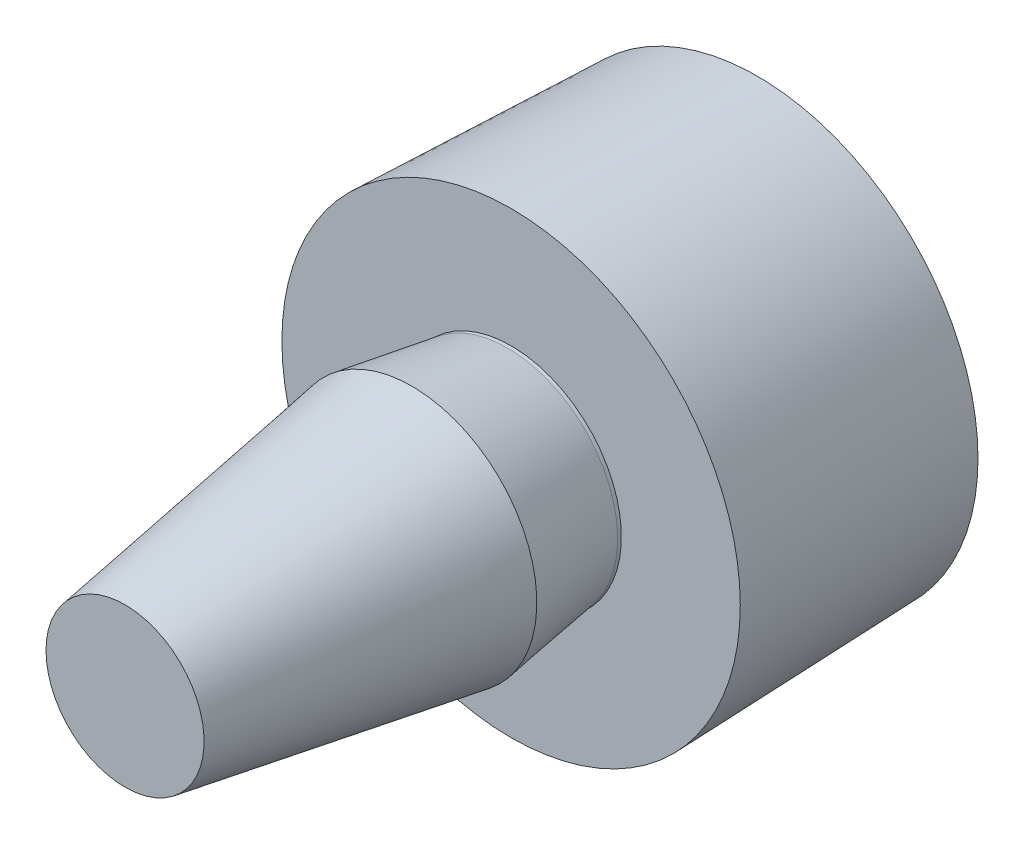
ISO-10303-21;
HEADER;
FILE_DESCRIPTION(('STEP AP214'),'2;1');
FILE_NAME('part.step','',(''),(''),'','','');
FILE_SCHEMA(('AUTOMOTIVE_DESIGN { 1 0 10303 214 1 1 1 1 }'));
ENDSEC;
DATA;
#1=APPLICATION_CONTEXT('core data for automotive mechanical design processes');
#2=APPLICATION_PROTOCOL_DEFINITION('international standard','automotive_design',2000,#1);
#3=PRODUCT_CONTEXT('',#1,'mechanical');
#4=PRODUCT('Part','Part','',(#3));
#5=PRODUCT_RELATED_PRODUCT_CATEGORY('part','',(#4));
#6=PRODUCT_DEFINITION_FORMATION('','',#4);
#7=PRODUCT_DEFINITION_CONTEXT('part definition',#1,'design');
#8=PRODUCT_DEFINITION('design','',#6,#7);
#9=PRODUCT_DEFINITION_SHAPE('','',#8);
#10=(LENGTH_UNIT() NAMED_UNIT(*) SI_UNIT(.MILLI.,.METRE.));
#11=(NAMED_UNIT(*) PLANE_ANGLE_UNIT() SI_UNIT($,.RADIAN.));
#12=(NAMED_UNIT(*) SI_UNIT($,.STERADIAN.) SOLID_ANGLE_UNIT());
#13=UNCERTAINTY_MEASURE_WITH_UNIT(LENGTH_MEASURE(1.E-05),#10,'distance_accuracy_value','');
#14=(GEOMETRIC_REPRESENTATION_CONTEXT(3) GLOBAL_UNCERTAINTY_ASSIGNED_CONTEXT((#13)) GLOBAL_UNIT_ASSIGNED_CONTEXT((#10,
#11,#12)) REPRESENTATION_CONTEXT('',''));
#15=CARTESIAN_POINT('',(0.,0.,0.));
#16=DIRECTION('',(0.,0.,1.));
#17=DIRECTION('',(1.,0.,0.));
#18=AXIS2_PLACEMENT_3D('',#15,#16,#17);
#19=CARTESIAN_POINT('',(0.,0.,0.));
#20=DIRECTION('',(0.,0.,0.999999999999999));
#21=DIRECTION('',(0.999999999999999,0.,0.));
#22=AXIS2_PLACEMENT_3D('',#19,#20,#21);
#23=CONICAL_SURFACE('',#22,6.,0.0349065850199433);
#24=CARTESIAN_POINT('',(0.,1.11022302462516E-13,6.70000000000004));
#25=DIRECTION('',(0.,0.,0.999999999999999));
#26=DIRECTION('',(0.999999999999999,0.,0.));
#27=AXIS2_PLACEMENT_3D('',#24,#25,#26);
#28=CIRCLE('',#27,6.23396915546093);
#29=CARTESIAN_POINT('',(6.23396915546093,0.,6.70000000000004));
#30=VERTEX_POINT('',#29);
#31=EDGE_CURVE('E36',#30,#30,#28,.T.);
#32=CARTESIAN_POINT('',(0.,0.,0.));
#33=DIRECTION('',(0.,0.,0.999999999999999));
#34=DIRECTION('',(0.999999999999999,0.,0.));
#35=AXIS2_PLACEMENT_3D('',#32,#33,#34);
#36=CIRCLE('',#35,6.);
#37=CARTESIAN_POINT('',(6.,0.,0.));
#38=VERTEX_POINT('',#37);
#39=EDGE_CURVE('E40',#38,#38,#36,.T.);
#40=CARTESIAN_POINT('',(6.23396915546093,0.,6.70000000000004));
#41=CARTESIAN_POINT('',(6.23153197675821,0.,6.63020833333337));
#42=CARTESIAN_POINT('',(6.22909479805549,0.,6.56041666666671));
#43=CARTESIAN_POINT('',(6.22422044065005,0.,6.42083333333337));
#44=CARTESIAN_POINT('',(6.22178326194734,0.,6.3510416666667));
#45=CARTESIAN_POINT('',(6.2169089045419,0.,6.21145833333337));
#46=CARTESIAN_POINT('',(6.21447172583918,0.,6.1416666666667));
#47=CARTESIAN_POINT('',(6.20959736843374,0.,6.00208333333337));
#48=CARTESIAN_POINT('',(6.20716018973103,0.,5.9322916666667));
#49=CARTESIAN_POINT('',(6.20228583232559,0.,5.79270833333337));
#50=CARTESIAN_POINT('',(6.19984865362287,0.,5.7229166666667));
#51=CARTESIAN_POINT('',(6.19497429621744,0.,5.58333333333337));
#52=CARTESIAN_POINT('',(6.19253711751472,0.,5.5135416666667));
#53=CARTESIAN_POINT('',(6.18766276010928,0.,5.37395833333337));
#54=CARTESIAN_POINT('',(6.18522558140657,0.,5.3041666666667));
#55=CARTESIAN_POINT('',(6.18035122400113,0.,5.16458333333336));
#56=CARTESIAN_POINT('',(6.17791404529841,0.,5.0947916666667));
#57=CARTESIAN_POINT('',(6.17303968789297,0.,4.95520833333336));
#58=CARTESIAN_POINT('',(6.17060250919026,0.,4.8854166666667));
#59=CARTESIAN_POINT('',(6.16572815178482,0.,4.74583333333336));
#60=CARTESIAN_POINT('',(6.1632909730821,0.,4.67604166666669));
#61=CARTESIAN_POINT('',(6.15841661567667,0.,4.53645833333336));
#62=CARTESIAN_POINT('',(6.15597943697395,0.,4.46666666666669));
#63=CARTESIAN_POINT('',(6.15110507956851,0.,4.32708333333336));
#64=CARTESIAN_POINT('',(6.14866790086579,0.,4.25729166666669));
#65=CARTESIAN_POINT('',(6.14379354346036,0.,4.11770833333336));
#66=CARTESIAN_POINT('',(6.14135636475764,0.,4.04791666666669));
#67=CARTESIAN_POINT('',(6.13648200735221,0.,3.90833333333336));
#68=CARTESIAN_POINT('',(6.13404482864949,0.,3.83854166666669));
#69=CARTESIAN_POINT('',(6.12917047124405,0.,3.69895833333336));
#70=CARTESIAN_POINT('',(6.12673329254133,0.,3.62916666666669));
#71=CARTESIAN_POINT('',(6.1218589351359,0.,3.48958333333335));
#72=CARTESIAN_POINT('',(6.11942175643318,0.,3.41979166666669));
#73=CARTESIAN_POINT('',(6.11454739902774,0.,3.28020833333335));
#74=CARTESIAN_POINT('',(6.11211022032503,0.,3.21041666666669));
#75=CARTESIAN_POINT('',(6.10723586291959,0.,3.07083333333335));
#76=CARTESIAN_POINT('',(6.10479868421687,0.,3.00104166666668));
#77=CARTESIAN_POINT('',(6.09992432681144,0.,2.86145833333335));
#78=CARTESIAN_POINT('',(6.09748714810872,0.,2.79166666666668));
#79=CARTESIAN_POINT('',(6.09261279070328,0.,2.65208333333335));
#80=CARTESIAN_POINT('',(6.09017561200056,0.,2.58229166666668));
#81=CARTESIAN_POINT('',(6.08530125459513,0.,2.44270833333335));
#82=CARTESIAN_POINT('',(6.08286407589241,0.,2.37291666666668));
#83=CARTESIAN_POINT('',(6.07798971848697,0.,2.23333333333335));
#84=CARTESIAN_POINT('',(6.07555253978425,0.,2.16354166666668));
#85=CARTESIAN_POINT('',(6.07067818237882,0.,2.02395833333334));
#86=CARTESIAN_POINT('',(6.0682410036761,0.,1.95416666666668));
#87=CARTESIAN_POINT('',(6.06336664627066,0.,1.81458333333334));
#88=CARTESIAN_POINT('',(6.06092946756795,0.,1.74479166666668));
#89=CARTESIAN_POINT('',(6.05605511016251,0.,1.60520833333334));
#90=CARTESIAN_POINT('',(6.05361793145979,0.,1.53541666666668));
#91=CARTESIAN_POINT('',(6.04874357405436,0.,1.39583333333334));
#92=CARTESIAN_POINT('',(6.04630639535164,0.,1.32604166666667));
#93=CARTESIAN_POINT('',(6.0414320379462,0.,1.18645833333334));
#94=CARTESIAN_POINT('',(6.03899485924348,0.,1.11666666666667));
#95=CARTESIAN_POINT('',(6.03412050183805,0.,0.977083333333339));
#96=CARTESIAN_POINT('',(6.03168332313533,0.,0.907291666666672));
#97=CARTESIAN_POINT('',(6.0268089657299,0.,0.767708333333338));
#98=CARTESIAN_POINT('',(6.02437178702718,0.,0.697916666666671));
#99=CARTESIAN_POINT('',(6.01949742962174,0.,0.558333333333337));
#100=CARTESIAN_POINT('',(6.01706025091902,0.,0.48854166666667));
#101=CARTESIAN_POINT('',(6.01218589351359,0.,0.348958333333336));
#102=CARTESIAN_POINT('',(6.00974871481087,0.,0.279166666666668));
#103=CARTESIAN_POINT('',(6.00487435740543,0.,0.139583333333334));
#104=CARTESIAN_POINT('',(6.00243717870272,0.,0.0697916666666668));
#105=CARTESIAN_POINT('',(6.,0.,0.));
#106=B_SPLINE_CURVE_WITH_KNOTS('',3,(#40,#41,#42,#43,#44,#45,#46,#47,#48,#49,#50,#51,#52,#53,
#54,#55,#56,#57,#58,#59,#60,#61,#62,#63,#64,#65,#66,#67,#68,#69,#70,#71,#72,#73,#74,#75,#76,#77,
#78,#79,#80,#81,#82,#83,#84,#85,#86,#87,#88,#89,#90,#91,#92,#93,#94,#95,#96,#97,#98,#99,#100,
#101,#102,#103,#104,#105),.UNSPECIFIED.,.F.,.F.,(4,2,2,2,2,2,2,2,2,2,2,2,2,2,2,2,2,2,2,2,2,2,2,
2,2,2,2,2,2,2,2,2,4),(0.,0.209502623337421,0.419005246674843,0.628507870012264,
0.838010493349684,1.04751311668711,1.25701574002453,1.46651836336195,1.67602098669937,
1.88552361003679,2.09502623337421,2.30452885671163,2.51403148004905,2.72353410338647,
2.9330367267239,3.14253935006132,3.35204197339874,3.56154459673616,3.77104722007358,
3.980549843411,4.19005246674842,4.39955509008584,4.60905771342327,4.81856033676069,
5.02806296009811,5.23756558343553,5.44706820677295,5.65657083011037,5.86607345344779,
6.07557607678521,6.28507870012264,6.49458132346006,6.70408394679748),.UNSPECIFIED.);
#107=EDGE_CURVE('BSEAM30',#30,#38,#106,.T.);
#108=ORIENTED_EDGE('',*,*,#31,.F.);
#109=ORIENTED_EDGE('',*,*,#39,.T.);
#110=ORIENTED_EDGE('',*,*,#107,.T.);
#111=ORIENTED_EDGE('',*,*,#107,.F.);
#112=EDGE_LOOP('',(#108,#110,#109,#111));
#113=FACE_BOUND('',#112,.T.);
#114=ADVANCED_FACE('F30',(#113),#23,.T.);
#115=CARTESIAN_POINT('',(0.,1.11022302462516E-13,6.70000000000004));
#116=DIRECTION('',(0.,0.,0.999999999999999));
#117=DIRECTION('',(0.999999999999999,0.,0.));
#118=AXIS2_PLACEMENT_3D('',#115,#116,#117);
#119=PLANE('',#118);
#120=CARTESIAN_POINT('',(0.,1.11022302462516E-13,6.70000000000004));
#121=DIRECTION('',(0.,0.,0.999999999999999));
#122=DIRECTION('',(0.999999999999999,0.,0.));
#123=AXIS2_PLACEMENT_3D('',#120,#121,#122);
#124=CIRCLE('',#123,3.);
#125=CARTESIAN_POINT('',(-3.00000000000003,0.,6.70000000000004));
#126=VERTEX_POINT('',#125);
#127=EDGE_CURVE('E10',#126,#126,#124,.T.);
#128=ORIENTED_EDGE('',*,*,#127,.F.);
#129=EDGE_LOOP('',(#128));
#130=FACE_BOUND('',#129,.T.);
#131=ORIENTED_EDGE('',*,*,#31,.T.);
#132=EDGE_LOOP('',(#131));
#133=FACE_BOUND('',#132,.T.);
#134=ADVANCED_FACE('F72',(#130,#133),#119,.T.);
#135=CARTESIAN_POINT('',(0.,0.,0.));
#136=DIRECTION('',(0.,0.,0.999999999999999));
#137=DIRECTION('',(0.999999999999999,0.,0.));
#138=AXIS2_PLACEMENT_3D('',#135,#136,#137);
#139=PLANE('',#138);
#140=ORIENTED_EDGE('',*,*,#39,.F.);
#141=EDGE_LOOP('',(#140));
#142=FACE_BOUND('',#141,.T.);
#143=ADVANCED_FACE('F77',(#142),#139,.F.);
#144=CARTESIAN_POINT('',(0.,2.1500000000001,17.2));
#145=DIRECTION('',(0.,0.,0.999999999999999));
#146=DIRECTION('',(0.999999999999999,0.,0.));
#147=AXIS2_PLACEMENT_3D('',#144,#145,#146);
#148=PLANE('',#147);
#149=CARTESIAN_POINT('',(0.,0.,17.2));
#150=DIRECTION('',(0.,0.,-0.999999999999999));
#151=DIRECTION('',(-0.999999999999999,0.,0.));
#152=AXIS2_PLACEMENT_3D('',#149,#150,#151);
#153=CIRCLE('',#152,2.15);
#154=CARTESIAN_POINT('',(-2.14999999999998,0.,17.2));
#155=VERTEX_POINT('',#154);
#156=EDGE_CURVE('E44',#155,#155,#153,.T.);
#157=ORIENTED_EDGE('',*,*,#156,.F.);
#158=EDGE_LOOP('',(#157));
#159=FACE_BOUND('',#158,.T.);
#160=ADVANCED_FACE('F68',(#159),#148,.T.);
#161=CARTESIAN_POINT('',(0.,0.,9.39999999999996));
#162=DIRECTION('',(0.,0.,-0.999999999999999));
#163=DIRECTION('',(-0.999999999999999,0.,0.));
#164=AXIS2_PLACEMENT_3D('',#161,#162,#163);
#165=CONICAL_SURFACE('',#164,3.4,0.158905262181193);
#166=CARTESIAN_POINT('',(0.,0.,9.39999999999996));
#167=DIRECTION('',(0.,0.,-0.999999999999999));
#168=DIRECTION('',(-0.999999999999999,0.,0.));
#169=AXIS2_PLACEMENT_3D('',#166,#167,#168);
#170=CIRCLE('',#169,3.4);
#171=CARTESIAN_POINT('',(-3.4,0.,9.39999999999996));
#172=VERTEX_POINT('',#171);
#173=EDGE_CURVE('E49',#172,#172,#170,.T.);
#174=CARTESIAN_POINT('',(-2.14999999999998,0.,17.2));
#175=CARTESIAN_POINT('',(-2.16302083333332,0.,17.11875));
#176=CARTESIAN_POINT('',(-2.17604166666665,0.,17.0375));
#177=CARTESIAN_POINT('',(-2.20208333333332,0.,16.875));
#178=CARTESIAN_POINT('',(-2.21510416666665,0.,16.79375));
#179=CARTESIAN_POINT('',(-2.24114583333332,0.,16.63125));
#180=CARTESIAN_POINT('',(-2.25416666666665,0.,16.55));
#181=CARTESIAN_POINT('',(-2.28020833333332,0.,16.3875));
#182=CARTESIAN_POINT('',(-2.29322916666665,0.,16.30625));
#183=CARTESIAN_POINT('',(-2.31927083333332,0.,16.14375));
#184=CARTESIAN_POINT('',(-2.33229166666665,0.,16.0625));
#185=CARTESIAN_POINT('',(-2.35833333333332,0.,15.9));
#186=CARTESIAN_POINT('',(-2.37135416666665,0.,15.81875));
#187=CARTESIAN_POINT('',(-2.39739583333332,0.,15.65625));
#188=CARTESIAN_POINT('',(-2.41041666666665,0.,15.575));
#189=CARTESIAN_POINT('',(-2.43645833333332,0.,15.4125));
#190=CARTESIAN_POINT('',(-2.44947916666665,0.,15.33125));
#191=CARTESIAN_POINT('',(-2.47552083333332,0.,15.16875));
#192=CARTESIAN_POINT('',(-2.48854166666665,0.,15.0875));
#193=CARTESIAN_POINT('',(-2.51458333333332,0.,14.925));
#194=CARTESIAN_POINT('',(-2.52760416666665,0.,14.84375));
#195=CARTESIAN_POINT('',(-2.55364583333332,0.,14.68125));
#196=CARTESIAN_POINT('',(-2.56666666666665,0.,14.6));
#197=CARTESIAN_POINT('',(-2.59270833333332,0.,14.4375));
#198=CARTESIAN_POINT('',(-2.60572916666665,0.,14.35625));
#199=CARTESIAN_POINT('',(-2.63177083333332,0.,14.19375));
#200=CARTESIAN_POINT('',(-2.64479166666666,0.,14.1125));
#201=CARTESIAN_POINT('',(-2.67083333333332,0.,13.95));
#202=CARTESIAN_POINT('',(-2.68385416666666,0.,13.86875));
#203=CARTESIAN_POINT('',(-2.70989583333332,0.,13.70625));
#204=CARTESIAN_POINT('',(-2.72291666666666,0.,13.625));
#205=CARTESIAN_POINT('',(-2.74895833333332,0.,13.4625));
#206=CARTESIAN_POINT('',(-2.76197916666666,0.,13.38125));
#207=CARTESIAN_POINT('',(-2.78802083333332,0.,13.21875));
#208=CARTESIAN_POINT('',(-2.80104166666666,0.,13.1375));
#209=CARTESIAN_POINT('',(-2.82708333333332,0.,12.975));
#210=CARTESIAN_POINT('',(-2.84010416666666,0.,12.89375));
#211=CARTESIAN_POINT('',(-2.86614583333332,0.,12.73125));
#212=CARTESIAN_POINT('',(-2.87916666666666,0.,12.65));
#213=CARTESIAN_POINT('',(-2.90520833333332,0.,12.4875));
#214=CARTESIAN_POINT('',(-2.91822916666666,0.,12.40625));
#215=CARTESIAN_POINT('',(-2.94427083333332,0.,12.24375));
#216=CARTESIAN_POINT('',(-2.95729166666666,0.,12.1625));
#217=CARTESIAN_POINT('',(-2.98333333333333,0.,12.));
#218=CARTESIAN_POINT('',(-2.99635416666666,0.,11.91875));
#219=CARTESIAN_POINT('',(-3.02239583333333,0.,11.75625));
#220=CARTESIAN_POINT('',(-3.03541666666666,0.,11.675));
#221=CARTESIAN_POINT('',(-3.06145833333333,0.,11.5125));
#222=CARTESIAN_POINT('',(-3.07447916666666,0.,11.43125));
#223=CARTESIAN_POINT('',(-3.10052083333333,0.,11.26875));
#224=CARTESIAN_POINT('',(-3.11354166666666,0.,11.1875));
#225=CARTESIAN_POINT('',(-3.13958333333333,0.,11.025));
#226=CARTESIAN_POINT('',(-3.15260416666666,0.,10.94375));
#227=CARTESIAN_POINT('',(-3.17864583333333,0.,10.78125));
#228=CARTESIAN_POINT('',(-3.19166666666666,0.,10.7));
#229=CARTESIAN_POINT('',(-3.21770833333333,0.,10.5375));
#230=CARTESIAN_POINT('',(-3.23072916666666,0.,10.45625));
#231=CARTESIAN_POINT('',(-3.25677083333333,0.,10.29375));
#232=CARTESIAN_POINT('',(-3.26979166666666,0.,10.2125));
#233=CARTESIAN_POINT('',(-3.29583333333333,0.,10.05));
#234=CARTESIAN_POINT('',(-3.30885416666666,0.,9.96874999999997));
#235=CARTESIAN_POINT('',(-3.33489583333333,0.,9.80624999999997));
#236=CARTESIAN_POINT('',(-3.34791666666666,0.,9.72499999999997));
#237=CARTESIAN_POINT('',(-3.37395833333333,0.,9.56249999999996));
#238=CARTESIAN_POINT('',(-3.38697916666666,0.,9.48124999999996));
#239=CARTESIAN_POINT('',(-3.4,0.,9.39999999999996));
#240=B_SPLINE_CURVE_WITH_KNOTS('',3,(#174,#175,#176,#177,#178,#179,#180,#181,#182,#183,#184,
#185,#186,#187,#188,#189,#190,#191,#192,#193,#194,#195,#196,#197,#198,#199,#200,#201,#202,#203,
#204,#205,#206,#207,#208,#209,#210,#211,#212,#213,#214,#215,#216,#217,#218,#219,#220,#221,#222,
#223,#224,#225,#226,#227,#228,#229,#230,#231,#232,#233,#234,#235,#236,#237,#238,#239),
.UNSPECIFIED.,.F.,.F.,(4,2,2,2,2,2,2,2,2,2,2,2,2,2,2,2,2,2,2,2,2,2,2,2,2,2,2,2,2,2,2,2,4),(0.,
0.246860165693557,0.493720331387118,0.740580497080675,0.987440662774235,1.23430082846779,
1.48116099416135,1.72802115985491,1.97488132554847,2.22174149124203,2.46860165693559,
2.71546182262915,2.96232198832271,3.20918215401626,3.45604231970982,3.70290248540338,
3.94976265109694,4.1966228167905,4.44348298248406,4.69034314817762,4.93720331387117,
5.18406347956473,5.43092364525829,5.67778381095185,5.92464397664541,6.17150414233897,
6.41836430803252,6.66522447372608,6.91208463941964,7.1589448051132,7.40580497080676,
7.65266513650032,7.89952530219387),.UNSPECIFIED.);
#241=EDGE_CURVE('BSEAM60',#155,#172,#240,.T.);
#242=ORIENTED_EDGE('',*,*,#156,.T.);
#243=ORIENTED_EDGE('',*,*,#173,.F.);
#244=ORIENTED_EDGE('',*,*,#241,.T.);
#245=ORIENTED_EDGE('',*,*,#241,.F.);
#246=EDGE_LOOP('',(#242,#244,#243,#245));
#247=FACE_BOUND('',#246,.T.);
#248=ADVANCED_FACE('F60',(#247),#165,.T.);
#249=CARTESIAN_POINT('',(0.,0.,6.79999999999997));
#250=DIRECTION('',(0.,0.,0.999999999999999));
#251=DIRECTION('',(0.999999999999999,0.,0.));
#252=AXIS2_PLACEMENT_3D('',#249,#250,#251);
#253=CONICAL_SURFACE('',#252,3.,0.152649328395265);
#254=ORIENTED_EDGE('',*,*,#173,.T.);
#255=EDGE_LOOP('',(#254));
#256=FACE_BOUND('',#255,.T.);
#257=CARTESIAN_POINT('',(0.,0.,6.79999999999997));
#258=DIRECTION('',(0.,0.,-0.999999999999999));
#259=DIRECTION('',(-0.999999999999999,0.,0.));
#260=AXIS2_PLACEMENT_3D('',#257,#258,#259);
#261=CIRCLE('',#260,3.);
#262=CARTESIAN_POINT('',(-3.00000000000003,0.,6.79999999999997));
#263=VERTEX_POINT('',#262);
#264=EDGE_CURVE('E52',#263,#263,#261,.T.);
#265=ORIENTED_EDGE('',*,*,#264,.F.);
#266=EDGE_LOOP('',(#265));
#267=FACE_BOUND('',#266,.T.);
#268=ADVANCED_FACE('F58',(#256,#267),#253,.T.);
#269=CARTESIAN_POINT('',(0.,0.,1.96411025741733));
#270=DIRECTION('',(0.,0.,-0.999999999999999));
#271=DIRECTION('',(-0.999999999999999,0.,0.));
#272=AXIS2_PLACEMENT_3D('',#269,#270,#271);
#273=CYLINDRICAL_SURFACE('',#272,3.);
#274=CARTESIAN_POINT('',(-3.00000000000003,0.,6.79999999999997));
#275=CARTESIAN_POINT('',(-3.00000000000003,0.,6.79895833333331));
#276=CARTESIAN_POINT('',(-3.00000000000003,0.,6.79791666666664));
#277=CARTESIAN_POINT('',(-3.00000000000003,0.,6.79583333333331));
#278=CARTESIAN_POINT('',(-3.00000000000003,0.,6.79479166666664));
#279=CARTESIAN_POINT('',(-3.00000000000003,0.,6.79270833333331));
#280=CARTESIAN_POINT('',(-3.00000000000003,0.,6.79166666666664));
#281=CARTESIAN_POINT('',(-3.00000000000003,0.,6.78958333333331));
#282=CARTESIAN_POINT('',(-3.00000000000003,0.,6.78854166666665));
#283=CARTESIAN_POINT('',(-3.00000000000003,0.,6.78645833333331));
#284=CARTESIAN_POINT('',(-3.00000000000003,0.,6.78541666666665));
#285=CARTESIAN_POINT('',(-3.00000000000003,0.,6.78333333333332));
#286=CARTESIAN_POINT('',(-3.00000000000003,0.,6.78229166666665));
#287=CARTESIAN_POINT('',(-3.00000000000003,0.,6.78020833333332));
#288=CARTESIAN_POINT('',(-3.00000000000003,0.,6.77916666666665));
#289=CARTESIAN_POINT('',(-3.00000000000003,0.,6.77708333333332));
#290=CARTESIAN_POINT('',(-3.00000000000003,0.,6.77604166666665));
#291=CARTESIAN_POINT('',(-3.00000000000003,0.,6.77395833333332));
#292=CARTESIAN_POINT('',(-3.00000000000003,0.,6.77291666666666));
#293=CARTESIAN_POINT('',(-3.00000000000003,0.,6.77083333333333));
#294=CARTESIAN_POINT('',(-3.00000000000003,0.,6.76979166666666));
#295=CARTESIAN_POINT('',(-3.00000000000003,0.,6.76770833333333));
#296=CARTESIAN_POINT('',(-3.00000000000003,0.,6.76666666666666));
#297=CARTESIAN_POINT('',(-3.00000000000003,0.,6.76458333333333));
#298=CARTESIAN_POINT('',(-3.00000000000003,0.,6.76354166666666));
#299=CARTESIAN_POINT('',(-3.00000000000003,0.,6.76145833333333));
#300=CARTESIAN_POINT('',(-3.00000000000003,0.,6.76041666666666));
#301=CARTESIAN_POINT('',(-3.00000000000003,0.,6.75833333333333));
#302=CARTESIAN_POINT('',(-3.00000000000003,0.,6.75729166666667));
#303=CARTESIAN_POINT('',(-3.00000000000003,0.,6.75520833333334));
#304=CARTESIAN_POINT('',(-3.00000000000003,0.,6.75416666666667));
#305=CARTESIAN_POINT('',(-3.00000000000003,0.,6.75208333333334));
#306=CARTESIAN_POINT('',(-3.00000000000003,0.,6.75104166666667));
#307=CARTESIAN_POINT('',(-3.00000000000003,0.,6.74895833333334));
#308=CARTESIAN_POINT('',(-3.00000000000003,0.,6.74791666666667));
#309=CARTESIAN_POINT('',(-3.00000000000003,0.,6.74583333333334));
#310=CARTESIAN_POINT('',(-3.00000000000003,0.,6.74479166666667));
#311=CARTESIAN_POINT('',(-3.00000000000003,0.,6.74270833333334));
#312=CARTESIAN_POINT('',(-3.00000000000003,0.,6.74166666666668));
#313=CARTESIAN_POINT('',(-3.00000000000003,0.,6.73958333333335));
#314=CARTESIAN_POINT('',(-3.00000000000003,0.,6.73854166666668));
#315=CARTESIAN_POINT('',(-3.00000000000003,0.,6.73645833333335));
#316=CARTESIAN_POINT('',(-3.00000000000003,0.,6.73541666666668));
#317=CARTESIAN_POINT('',(-3.00000000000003,0.,6.73333333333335));
#318=CARTESIAN_POINT('',(-3.00000000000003,0.,6.73229166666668));
#319=CARTESIAN_POINT('',(-3.00000000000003,0.,6.73020833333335));
#320=CARTESIAN_POINT('',(-3.00000000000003,0.,6.72916666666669));
#321=CARTESIAN_POINT('',(-3.00000000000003,0.,6.72708333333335));
#322=CARTESIAN_POINT('',(-3.00000000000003,0.,6.72604166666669));
#323=CARTESIAN_POINT('',(-3.00000000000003,0.,6.72395833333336));
#324=CARTESIAN_POINT('',(-3.00000000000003,0.,6.72291666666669));
#325=CARTESIAN_POINT('',(-3.00000000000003,0.,6.72083333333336));
#326=CARTESIAN_POINT('',(-3.00000000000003,0.,6.71979166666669));
#327=CARTESIAN_POINT('',(-3.00000000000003,0.,6.71770833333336));
#328=CARTESIAN_POINT('',(-3.00000000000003,0.,6.71666666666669));
#329=CARTESIAN_POINT('',(-3.00000000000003,0.,6.71458333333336));
#330=CARTESIAN_POINT('',(-3.00000000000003,0.,6.7135416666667));
#331=CARTESIAN_POINT('',(-3.00000000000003,0.,6.71145833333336));
#332=CARTESIAN_POINT('',(-3.00000000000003,0.,6.7104166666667));
#333=CARTESIAN_POINT('',(-3.00000000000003,0.,6.70833333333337));
#334=CARTESIAN_POINT('',(-3.00000000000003,0.,6.7072916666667));
#335=CARTESIAN_POINT('',(-3.00000000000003,0.,6.70520833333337));
#336=CARTESIAN_POINT('',(-3.00000000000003,0.,6.7041666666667));
#337=CARTESIAN_POINT('',(-3.00000000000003,0.,6.70208333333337));
#338=CARTESIAN_POINT('',(-3.00000000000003,0.,6.7010416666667));
#339=CARTESIAN_POINT('',(-3.00000000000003,0.,6.70000000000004));
#340=B_SPLINE_CURVE_WITH_KNOTS('',3,(#274,#275,#276,#277,#278,#279,#280,#281,#282,#283,#284,
#285,#286,#287,#288,#289,#290,#291,#292,#293,#294,#295,#296,#297,#298,#299,#300,#301,#302,#303,
#304,#305,#306,#307,#308,#309,#310,#311,#312,#313,#314,#315,#316,#317,#318,#319,#320,#321,#322,
#323,#324,#325,#326,#327,#328,#329,#330,#331,#332,#333,#334,#335,#336,#337,#338,#339),
.UNSPECIFIED.,.F.,.F.,(4,2,2,2,2,2,2,2,2,2,2,2,2,2,2,2,2,2,2,2,2,2,2,2,2,2,2,2,2,2,2,2,4),(0.,
0.00312499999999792,0.00624999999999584,0.00937499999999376,0.0124999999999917,
0.0156249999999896,0.0187499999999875,0.0218749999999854,0.0249999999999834,0.0281249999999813,
0.0312499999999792,0.0343749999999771,0.0374999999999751,0.040624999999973,0.0437499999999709,
0.0468749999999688,0.0499999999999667,0.0531249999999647,0.0562499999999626,0.0593749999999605,
0.0624999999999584,0.0656249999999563,0.0687499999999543,0.0718749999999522,0.0749999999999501,
0.078124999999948,0.0812499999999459,0.0843749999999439,0.0874999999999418,0.0906249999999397,
0.0937499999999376,0.0968749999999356,0.0999999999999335),.UNSPECIFIED.);
#341=EDGE_CURVE('BSEAM56',#263,#126,#340,.T.);
#342=ORIENTED_EDGE('',*,*,#264,.T.);
#343=ORIENTED_EDGE('',*,*,#127,.T.);
#344=ORIENTED_EDGE('',*,*,#341,.T.);
#345=ORIENTED_EDGE('',*,*,#341,.F.);
#346=EDGE_LOOP('',(#342,#344,#343,#345));
#347=FACE_BOUND('',#346,.T.);
#348=ADVANCED_FACE('F56',(#347),#273,.T.);
#349=CLOSED_SHELL('',(#114,#134,#143,#160,#248,#268,#348));
#350=MANIFOLD_SOLID_BREP('B2',#349);
#351=ADVANCED_BREP_SHAPE_REPRESENTATION('',(#18,#350),#14);
#352=SHAPE_DEFINITION_REPRESENTATION(#9,#351);
ENDSEC;
END-ISO-10303-21;
